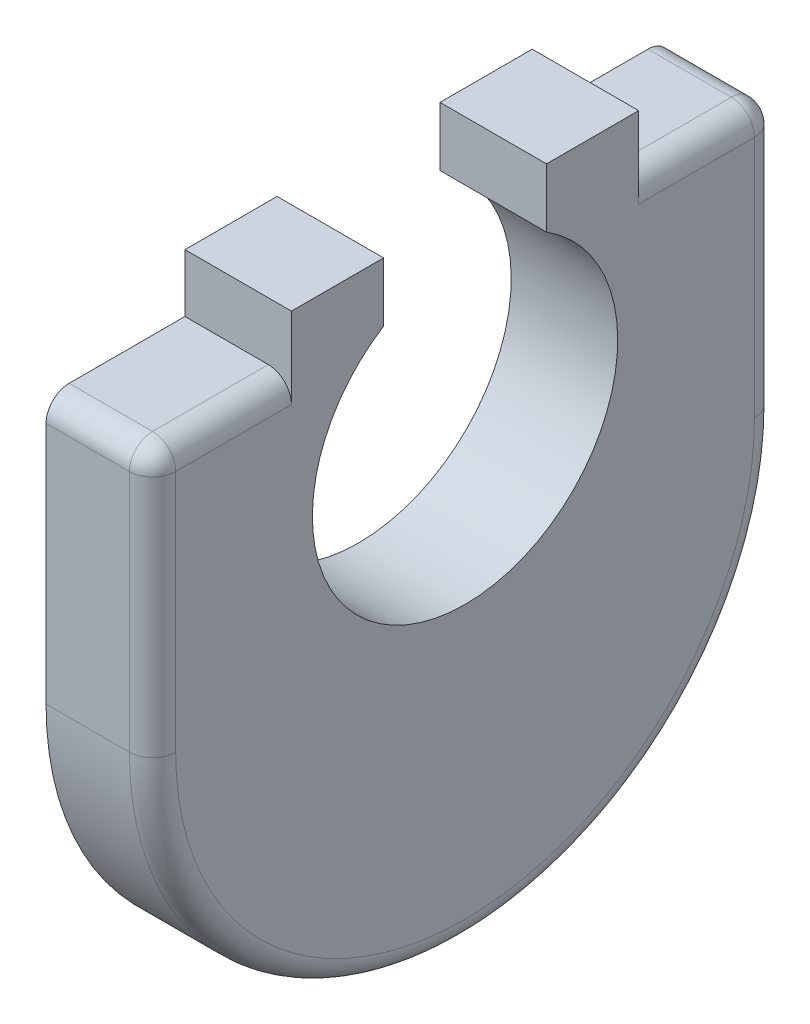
from build123d import *

# Parameters (mm, degrees)
BOSS_EXTRUDE1_DEPTH = 2.921
FILLET1_R           = 1.27
CUT_EXTRUDE2_DEPTH  = 26.381260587
CUT_EXTRUDE3_DEPTH  = 2.794


with BuildPart() as part:
    # Sketch1 → Boss-Extrude1 (new, symmetric)
    with BuildSketch(Plane(origin=(0, 0, 0), x_dir=(0, 0, -1), z_dir=(1, 0, 0))):
        with BuildLine():
            Line((-17.145, 0), (-17.145, 14.605))
            Line((-17.145, 14.605), (-9.525, 14.605))
            Line((-9.525, 14.605), (-9.525, 17.78))
            Line((-9.525, 17.78), (9.525, 17.78))
            Line((9.525, 17.78), (9.525, 14.605))
            Line((9.525, 14.605), (17.145, 14.605))
            Line((17.145, 14.605), (17.145, 0))
            ThreePointArc((17.145, 0), (0, -17.145), (-17.145, 0))
        make_face()
    extrude(amount=BOSS_EXTRUDE1_DEPTH, both=True)

    # Fillet1
    fillet1_edges = [part.edges().sort_by_distance(p)[0] for p in [
        (2.921, 14.605, -13.335),
        (0, 14.605, 17.145),
        (0, 14.605, -17.145),
        (2.921, 14.605, 13.335),
        (2.921, 7.3025, 17.145),
        (2.921, -17.145, 0),
        (2.921, 7.3025, -17.145),
    ]]
    fillet(fillet1_edges, radius=FILLET1_R)

    # Sketch2 → Cut-Extrude2 (cut, through all)
    with BuildSketch(Plane(origin=(2.921, 0, 0), x_dir=(0, 0, -1), z_dir=(1, 0, 0))):
        with BuildLine():
            Line((4.468488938, 17.78), (-4.468488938, 17.78))
            Line((-4.468488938, 17.78), (-4.468488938, 14.538622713))
            ThreePointArc((-4.468488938, 14.538622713), (0, -0.921102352), (4.468488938, 14.538622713))
            Line((4.468488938, 14.538622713), (4.468488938, 17.78))
        make_face()
    extrude(amount=-CUT_EXTRUDE2_DEPTH, mode=Mode.SUBTRACT)

    # Sketch3 → Cut-Extrude3 (cut)
    with BuildSketch(Plane.ZY.offset(2.921)):
        with BuildLine():
            Line((-10.285057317, 11.811), (-14.351, 11.811))
            Line((-14.351, 11.811), (-14.351, 0))
            ThreePointArc((-14.351, 0), (0, -14.351), (14.351, 0))
            Line((14.351, 0), (14.351, 11.811))
            Line((14.351, 11.811), (10.285057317, 11.811))
            ThreePointArc((10.285057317, 11.811), (0, -3.715102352), (-10.285057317, 11.811))
        make_face()
    extrude(amount=-CUT_EXTRUDE3_DEPTH, mode=Mode.SUBTRACT)


solid = part.part
